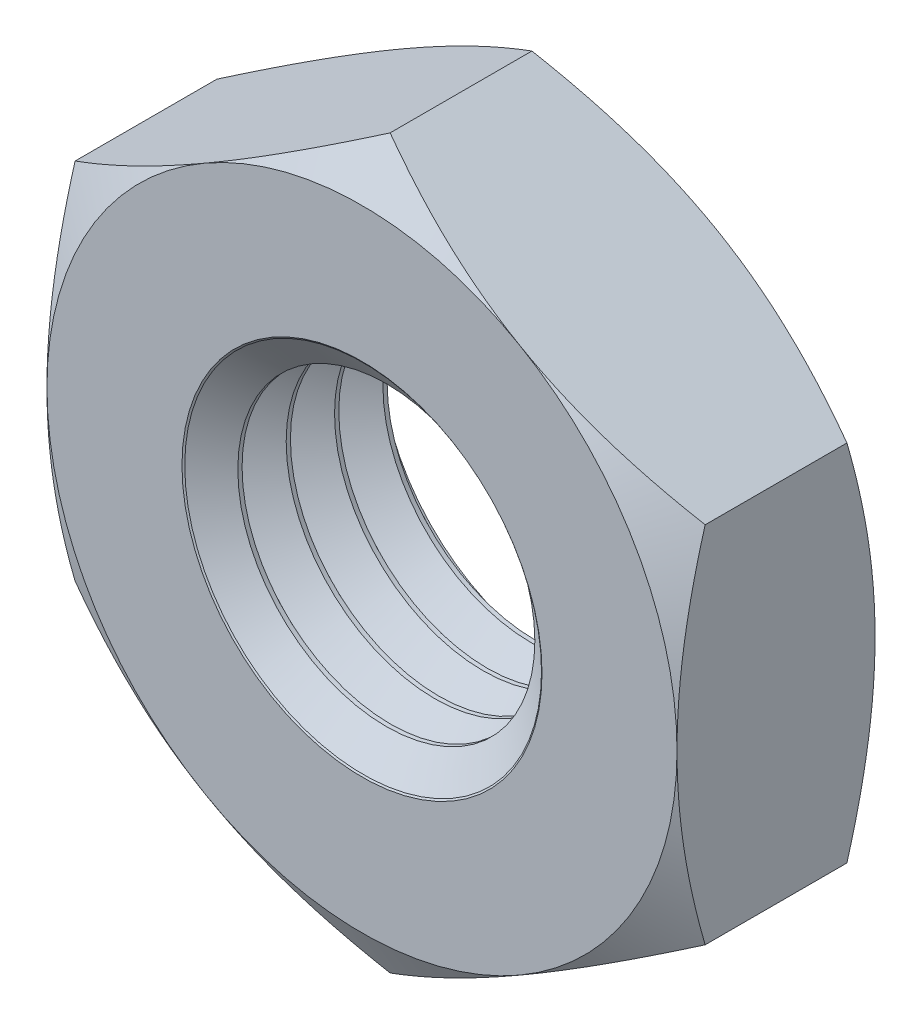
ISO-10303-21;
HEADER;
FILE_DESCRIPTION(('STEP AP214'),'2;1');
FILE_NAME('part.step','',(''),(''),'','','');
FILE_SCHEMA(('AUTOMOTIVE_DESIGN { 1 0 10303 214 1 1 1 1 }'));
ENDSEC;
DATA;
#1=APPLICATION_CONTEXT('core data for automotive mechanical design processes');
#2=APPLICATION_PROTOCOL_DEFINITION('international standard','automotive_design',2000,#1);
#3=PRODUCT_CONTEXT('',#1,'mechanical');
#4=PRODUCT('Part','Part','',(#3));
#5=PRODUCT_RELATED_PRODUCT_CATEGORY('part','',(#4));
#6=PRODUCT_DEFINITION_FORMATION('','',#4);
#7=PRODUCT_DEFINITION_CONTEXT('part definition',#1,'design');
#8=PRODUCT_DEFINITION('design','',#6,#7);
#9=PRODUCT_DEFINITION_SHAPE('','',#8);
#10=(LENGTH_UNIT() NAMED_UNIT(*) SI_UNIT(.MILLI.,.METRE.));
#11=(NAMED_UNIT(*) PLANE_ANGLE_UNIT() SI_UNIT($,.RADIAN.));
#12=(NAMED_UNIT(*) SI_UNIT($,.STERADIAN.) SOLID_ANGLE_UNIT());
#13=UNCERTAINTY_MEASURE_WITH_UNIT(LENGTH_MEASURE(1.E-05),#10,'distance_accuracy_value','');
#14=(GEOMETRIC_REPRESENTATION_CONTEXT(3) GLOBAL_UNCERTAINTY_ASSIGNED_CONTEXT((#13)) GLOBAL_UNIT_ASSIGNED_CONTEXT((#10,
#11,#12)) REPRESENTATION_CONTEXT('',''));
#15=CARTESIAN_POINT('',(0.,0.,0.));
#16=DIRECTION('',(0.,0.,1.));
#17=DIRECTION('',(1.,0.,0.));
#18=AXIS2_PLACEMENT_3D('',#15,#16,#17);
#19=CARTESIAN_POINT('',(0.,0.,-2.2));
#20=DIRECTION('',(0.,0.,1.));
#21=DIRECTION('',(1.,0.,0.));
#22=AXIS2_PLACEMENT_3D('',#19,#20,#21);
#23=CYLINDRICAL_SURFACE('',#22,1.65);
#24=CARTESIAN_POINT('',(0.,0.,-1.8823726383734));
#25=DIRECTION('',(0.,0.,-1.));
#26=DIRECTION('',(-1.,0.,0.));
#27=AXIS2_PLACEMENT_3D('',#24,#25,#26);
#28=CIRCLE('',#27,1.65);
#29=CARTESIAN_POINT('',(-1.65,0.,-1.8823726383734));
#30=VERTEX_POINT('',#29);
#31=EDGE_CURVE('E358',#30,#30,#28,.T.);
#32=ORIENTED_EDGE('',*,*,#31,.F.);
#33=EDGE_LOOP('',(#32));
#34=FACE_BOUND('',#33,.T.);
#35=CARTESIAN_POINT('',(0.,0.,-1.9295273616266));
#36=DIRECTION('',(0.,0.,-1.));
#37=DIRECTION('',(-1.,0.,0.));
#38=AXIS2_PLACEMENT_3D('',#35,#36,#37);
#39=CIRCLE('',#38,1.65);
#40=CARTESIAN_POINT('',(-1.65,0.,-1.9295273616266));
#41=VERTEX_POINT('',#40);
#42=EDGE_CURVE('E179',#41,#41,#39,.F.);
#43=ORIENTED_EDGE('',*,*,#42,.F.);
#44=EDGE_LOOP('',(#43));
#45=FACE_BOUND('',#44,.T.);
#46=ADVANCED_FACE('F37',(#34,#45),#23,.F.);
#47=CARTESIAN_POINT('',(0.,0.,-1.39222736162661));
#48=DIRECTION('',(0.,0.,-1.));
#49=DIRECTION('',(-1.,0.,0.));
#50=AXIS2_PLACEMENT_3D('',#47,#48,#49);
#51=CIRCLE('',#50,1.65);
#52=CARTESIAN_POINT('',(-1.65,0.,-1.39222736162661));
#53=VERTEX_POINT('',#52);
#54=EDGE_CURVE('E361',#53,#53,#51,.T.);
#55=ORIENTED_EDGE('',*,*,#54,.T.);
#56=EDGE_LOOP('',(#55));
#57=FACE_BOUND('',#56,.T.);
#58=CARTESIAN_POINT('',(0.,0.,-1.3450726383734));
#59=DIRECTION('',(0.,0.,-1.));
#60=DIRECTION('',(-1.,0.,0.));
#61=AXIS2_PLACEMENT_3D('',#58,#59,#60);
#62=CIRCLE('',#61,1.65);
#63=CARTESIAN_POINT('',(-1.65,0.,-1.3450726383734));
#64=VERTEX_POINT('',#63);
#65=EDGE_CURVE('E349',#64,#64,#62,.T.);
#66=ORIENTED_EDGE('',*,*,#65,.F.);
#67=EDGE_LOOP('',(#66));
#68=FACE_BOUND('',#67,.T.);
#69=ADVANCED_FACE('F309',(#57,#68),#23,.F.);
#70=CARTESIAN_POINT('',(0.,0.,-0.854927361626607));
#71=DIRECTION('',(0.,0.,-1.));
#72=DIRECTION('',(-1.,0.,0.));
#73=AXIS2_PLACEMENT_3D('',#70,#71,#72);
#74=CIRCLE('',#73,1.65);
#75=CARTESIAN_POINT('',(-1.65,0.,-0.854927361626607));
#76=VERTEX_POINT('',#75);
#77=EDGE_CURVE('E352',#76,#76,#74,.T.);
#78=ORIENTED_EDGE('',*,*,#77,.T.);
#79=EDGE_LOOP('',(#78));
#80=FACE_BOUND('',#79,.T.);
#81=CARTESIAN_POINT('',(0.,0.,-0.807772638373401));
#82=DIRECTION('',(0.,0.,-1.));
#83=DIRECTION('',(-1.,0.,0.));
#84=AXIS2_PLACEMENT_3D('',#81,#82,#83);
#85=CIRCLE('',#84,1.65);
#86=CARTESIAN_POINT('',(-1.65,0.,-0.807772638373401));
#87=VERTEX_POINT('',#86);
#88=EDGE_CURVE('E340',#87,#87,#85,.T.);
#89=ORIENTED_EDGE('',*,*,#88,.F.);
#90=EDGE_LOOP('',(#89));
#91=FACE_BOUND('',#90,.T.);
#92=ADVANCED_FACE('F315',(#80,#91),#23,.F.);
#93=CARTESIAN_POINT('',(0.,0.,-0.317627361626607));
#94=DIRECTION('',(0.,0.,-1.));
#95=DIRECTION('',(-1.,0.,0.));
#96=AXIS2_PLACEMENT_3D('',#93,#94,#95);
#97=CIRCLE('',#96,1.65);
#98=CARTESIAN_POINT('',(-1.65,0.,-0.317627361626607));
#99=VERTEX_POINT('',#98);
#100=EDGE_CURVE('E330',#99,#99,#97,.T.);
#101=ORIENTED_EDGE('',*,*,#100,.T.);
#102=EDGE_LOOP('',(#101));
#103=FACE_BOUND('',#102,.T.);
#104=CARTESIAN_POINT('',(0.,0.,-0.270472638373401));
#105=DIRECTION('',(0.,0.,-1.));
#106=DIRECTION('',(-1.,0.,0.));
#107=AXIS2_PLACEMENT_3D('',#104,#105,#106);
#108=CIRCLE('',#107,1.65);
#109=CARTESIAN_POINT('',(-1.65,0.,-0.270472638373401));
#110=VERTEX_POINT('',#109);
#111=EDGE_CURVE('E333',#110,#110,#108,.T.);
#112=ORIENTED_EDGE('',*,*,#111,.F.);
#113=EDGE_LOOP('',(#112));
#114=FACE_BOUND('',#113,.T.);
#115=ADVANCED_FACE('F311',(#103,#114),#23,.F.);
#116=CARTESIAN_POINT('',(0.,4.04145188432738,-2.2));
#117=DIRECTION('',(-0.500000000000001,0.866025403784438,0.));
#118=DIRECTION('',(-0.866025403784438,-0.500000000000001,0.));
#119=AXIS2_PLACEMENT_3D('',#116,#117,#118);
#120=PLANE('',#119);
#121=DIRECTION('',(0.,0.,1.));
#122=VECTOR('',#121,1.);
#123=CARTESIAN_POINT('',(-3.5,2.02072594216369,-2.2));
#124=LINE('',#123,#122);
#125=CARTESIAN_POINT('',(-3.5,2.02072594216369,-1.88739260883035));
#126=VERTEX_POINT('',#125);
#127=CARTESIAN_POINT('',(-3.5,2.02072594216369,-0.312607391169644));
#128=VERTEX_POINT('',#127);
#129=EDGE_CURVE('E167',#126,#128,#124,.T.);
#130=ORIENTED_EDGE('',*,*,#129,.T.);
#131=CARTESIAN_POINT('',(-3.5002,2.02061047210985,-0.312674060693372));
#132=CARTESIAN_POINT('',(-3.34639282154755,2.10941108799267,-0.261385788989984));
#133=CARTESIAN_POINT('',(-3.19125798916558,2.19897822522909,-0.214740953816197));
#134=CARTESIAN_POINT('',(-2.87830199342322,2.37966345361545,-0.133321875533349));
#135=CARTESIAN_POINT('',(-2.7204752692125,2.47078475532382,-0.098576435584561));
#136=CARTESIAN_POINT('',(-2.40677778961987,2.65189807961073,-0.0444900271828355));
#137=CARTESIAN_POINT('',(-2.25095530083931,2.74186223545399,-0.024789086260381));
#138=CARTESIAN_POINT('',(-1.93857711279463,2.92221386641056,-0.00127013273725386));
#139=CARTESIAN_POINT('',(-1.78202254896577,3.01260068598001,0.00256735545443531));
#140=CARTESIAN_POINT('',(-1.48949078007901,3.1814939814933,-0.00541530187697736));
#141=CARTESIAN_POINT('',(-1.35346978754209,3.26002573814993,-0.015275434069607));
#142=CARTESIAN_POINT('',(-1.08231397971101,3.41657761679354,-0.0465264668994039));
#143=CARTESIAN_POINT('',(-0.947180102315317,3.49459719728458,-0.0679280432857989));
#144=CARTESIAN_POINT('',(-0.675465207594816,3.65147186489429,-0.121430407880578));
#145=CARTESIAN_POINT('',(-0.538918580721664,3.73030709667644,-0.153757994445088));
#146=CARTESIAN_POINT('',(-0.267861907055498,3.88680174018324,-0.227128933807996));
#147=CARTESIAN_POINT('',(-0.133348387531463,3.96446315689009,-0.268155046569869));
#148=CARTESIAN_POINT('',(0.00020000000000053,4.04156735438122,-0.312674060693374));
#149=B_SPLINE_CURVE_WITH_KNOTS('',3,(#131,#132,#133,#134,#135,#136,#137,#138,#139,#140,#141,
#142,#143,#144,#145,#146,#147,#148),.UNSPECIFIED.,.F.,.F.,(4,2,2,2,2,2,2,2,4),(0.,
0.554793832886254,1.11092123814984,1.65328467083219,2.19498204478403,2.6666513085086,
3.13875761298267,3.6213361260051,4.10296698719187),.UNSPECIFIED.);
#150=CARTESIAN_POINT('',(-1.75,3.03108891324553,0.));
#151=VERTEX_POINT('',#150);
#152=EDGE_CURVE('E136',#128,#151,#149,.T.);
#153=ORIENTED_EDGE('',*,*,#152,.T.);
#154=CARTESIAN_POINT('',(0.,4.04145188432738,-0.312607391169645));
#155=VERTEX_POINT('',#154);
#156=EDGE_CURVE('E56',#151,#155,#149,.T.);
#157=ORIENTED_EDGE('',*,*,#156,.T.);
#158=DIRECTION('',(0.,0.,1.));
#159=VECTOR('',#158,1.);
#160=CARTESIAN_POINT('',(0.,4.04145188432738,-2.2));
#161=LINE('',#160,#159);
#162=CARTESIAN_POINT('',(0.,4.04145188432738,-1.88739260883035));
#163=VERTEX_POINT('',#162);
#164=EDGE_CURVE('E152',#163,#155,#161,.T.);
#165=ORIENTED_EDGE('',*,*,#164,.F.);
#166=CARTESIAN_POINT('',(-3.5002,2.02061047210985,-1.88732593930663));
#167=CARTESIAN_POINT('',(-3.34639282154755,2.10941108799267,-1.93861421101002));
#168=CARTESIAN_POINT('',(-3.19125798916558,2.19897822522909,-1.9852590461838));
#169=CARTESIAN_POINT('',(-2.87830199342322,2.37966345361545,-2.06667812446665));
#170=CARTESIAN_POINT('',(-2.7204752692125,2.47078475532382,-2.10142356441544));
#171=CARTESIAN_POINT('',(-2.40677778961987,2.65189807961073,-2.15550997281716));
#172=CARTESIAN_POINT('',(-2.25095530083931,2.74186223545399,-2.17521091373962));
#173=CARTESIAN_POINT('',(-1.93857711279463,2.92221386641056,-2.19872986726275));
#174=CARTESIAN_POINT('',(-1.78202254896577,3.01260068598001,-2.20256735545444));
#175=CARTESIAN_POINT('',(-1.48949078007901,3.1814939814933,-2.19458469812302));
#176=CARTESIAN_POINT('',(-1.35346978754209,3.26002573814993,-2.18472456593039));
#177=CARTESIAN_POINT('',(-1.08231397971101,3.41657761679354,-2.1534735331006));
#178=CARTESIAN_POINT('',(-0.947180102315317,3.49459719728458,-2.1320719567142));
#179=CARTESIAN_POINT('',(-0.675465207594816,3.65147186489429,-2.07856959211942));
#180=CARTESIAN_POINT('',(-0.538918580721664,3.73030709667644,-2.04624200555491));
#181=CARTESIAN_POINT('',(-0.267861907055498,3.88680174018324,-1.972871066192));
#182=CARTESIAN_POINT('',(-0.133348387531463,3.96446315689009,-1.93184495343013));
#183=CARTESIAN_POINT('',(0.000200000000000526,4.04156735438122,-1.88732593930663));
#184=B_SPLINE_CURVE_WITH_KNOTS('',3,(#166,#167,#168,#169,#170,#171,#172,#173,#174,#175,#176,
#177,#178,#179,#180,#181,#182,#183),.UNSPECIFIED.,.F.,.F.,(4,2,2,2,2,2,2,2,4),(0.,
0.554793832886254,1.11092123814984,1.65328467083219,2.19498204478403,2.6666513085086,
3.13875761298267,3.6213361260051,4.10296698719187),.UNSPECIFIED.);
#185=CARTESIAN_POINT('',(-1.75,3.03108891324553,-2.2));
#186=VERTEX_POINT('',#185);
#187=EDGE_CURVE('E170',#186,#163,#184,.T.);
#188=ORIENTED_EDGE('',*,*,#187,.F.);
#189=EDGE_CURVE('E268',#126,#186,#184,.T.);
#190=ORIENTED_EDGE('',*,*,#189,.F.);
#191=EDGE_LOOP('',(#130,#153,#157,#165,#188,#190));
#192=FACE_BOUND('',#191,.T.);
#193=ADVANCED_FACE('F39',(#192),#120,.T.);
#194=CARTESIAN_POINT('',(3.5,2.02072594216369,-2.2));
#195=DIRECTION('',(0.500000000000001,0.866025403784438,0.));
#196=DIRECTION('',(-0.866025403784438,0.500000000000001,0.));
#197=AXIS2_PLACEMENT_3D('',#194,#195,#196);
#198=PLANE('',#197);
#199=ORIENTED_EDGE('',*,*,#164,.T.);
#200=CARTESIAN_POINT('',(-0.000199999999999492,4.04156735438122,-0.312674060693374));
#201=CARTESIAN_POINT('',(0.15360717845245,3.9527667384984,-0.261385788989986));
#202=CARTESIAN_POINT('',(0.308742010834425,3.86319960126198,-0.214740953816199));
#203=CARTESIAN_POINT('',(0.621698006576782,3.68251437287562,-0.13332187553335));
#204=CARTESIAN_POINT('',(0.779524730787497,3.59139307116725,-0.098576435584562));
#205=CARTESIAN_POINT('',(1.09322221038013,3.41027974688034,-0.044490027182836));
#206=CARTESIAN_POINT('',(1.24904469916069,3.32031559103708,-0.0247890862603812));
#207=CARTESIAN_POINT('',(1.56142288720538,3.13996396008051,-0.00127013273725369));
#208=CARTESIAN_POINT('',(1.71797745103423,3.04957714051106,0.00256735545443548));
#209=CARTESIAN_POINT('',(2.01050921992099,2.88068384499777,-0.00541530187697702));
#210=CARTESIAN_POINT('',(2.14653021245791,2.80215208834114,-0.0152754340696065));
#211=CARTESIAN_POINT('',(2.417686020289,2.64560020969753,-0.0465264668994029));
#212=CARTESIAN_POINT('',(2.55281989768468,2.56758062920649,-0.0679280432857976));
#213=CARTESIAN_POINT('',(2.82453479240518,2.41070596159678,-0.121430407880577));
#214=CARTESIAN_POINT('',(2.96108141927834,2.33187072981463,-0.153757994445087));
#215=CARTESIAN_POINT('',(3.2321380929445,2.17537608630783,-0.227128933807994));
#216=CARTESIAN_POINT('',(3.36665161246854,2.09771466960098,-0.268155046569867));
#217=CARTESIAN_POINT('',(3.5002,2.02061047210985,-0.312674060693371));
#218=B_SPLINE_CURVE_WITH_KNOTS('',3,(#200,#201,#202,#203,#204,#205,#206,#207,#208,#209,#210,
#211,#212,#213,#214,#215,#216,#217),.UNSPECIFIED.,.F.,.F.,(4,2,2,2,2,2,2,2,4),(0.,
0.554793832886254,1.11092123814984,1.65328467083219,2.19498204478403,2.6666513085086,
3.13875761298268,3.6213361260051,4.10296698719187),.UNSPECIFIED.);
#219=CARTESIAN_POINT('',(1.75,3.03108891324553,0.));
#220=VERTEX_POINT('',#219);
#221=EDGE_CURVE('E146',#155,#220,#218,.T.);
#222=ORIENTED_EDGE('',*,*,#221,.T.);
#223=CARTESIAN_POINT('',(3.5,2.02072594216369,-0.312607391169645));
#224=VERTEX_POINT('',#223);
#225=EDGE_CURVE('E63',#220,#224,#218,.T.);
#226=ORIENTED_EDGE('',*,*,#225,.T.);
#227=DIRECTION('',(0.,0.,1.));
#228=VECTOR('',#227,1.);
#229=CARTESIAN_POINT('',(3.5,2.02072594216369,-2.2));
#230=LINE('',#229,#228);
#231=CARTESIAN_POINT('',(3.5,2.02072594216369,-1.88739260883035));
#232=VERTEX_POINT('',#231);
#233=EDGE_CURVE('E145',#232,#224,#230,.T.);
#234=ORIENTED_EDGE('',*,*,#233,.F.);
#235=CARTESIAN_POINT('',(-0.000199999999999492,4.04156735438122,-1.88732593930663));
#236=CARTESIAN_POINT('',(0.15360717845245,3.9527667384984,-1.93861421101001));
#237=CARTESIAN_POINT('',(0.308742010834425,3.86319960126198,-1.9852590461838));
#238=CARTESIAN_POINT('',(0.621698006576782,3.68251437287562,-2.06667812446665));
#239=CARTESIAN_POINT('',(0.779524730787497,3.59139307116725,-2.10142356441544));
#240=CARTESIAN_POINT('',(1.09322221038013,3.41027974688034,-2.15550997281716));
#241=CARTESIAN_POINT('',(1.24904469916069,3.32031559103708,-2.17521091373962));
#242=CARTESIAN_POINT('',(1.56142288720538,3.13996396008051,-2.19872986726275));
#243=CARTESIAN_POINT('',(1.71797745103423,3.04957714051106,-2.20256735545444));
#244=CARTESIAN_POINT('',(2.01050921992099,2.88068384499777,-2.19458469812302));
#245=CARTESIAN_POINT('',(2.14653021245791,2.80215208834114,-2.18472456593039));
#246=CARTESIAN_POINT('',(2.417686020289,2.64560020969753,-2.1534735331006));
#247=CARTESIAN_POINT('',(2.55281989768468,2.56758062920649,-2.1320719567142));
#248=CARTESIAN_POINT('',(2.82453479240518,2.41070596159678,-2.07856959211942));
#249=CARTESIAN_POINT('',(2.96108141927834,2.33187072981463,-2.04624200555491));
#250=CARTESIAN_POINT('',(3.2321380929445,2.17537608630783,-1.97287106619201));
#251=CARTESIAN_POINT('',(3.36665161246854,2.09771466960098,-1.93184495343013));
#252=CARTESIAN_POINT('',(3.5002,2.02061047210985,-1.88732593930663));
#253=B_SPLINE_CURVE_WITH_KNOTS('',3,(#235,#236,#237,#238,#239,#240,#241,#242,#243,#244,#245,
#246,#247,#248,#249,#250,#251,#252),.UNSPECIFIED.,.F.,.F.,(4,2,2,2,2,2,2,2,4),(0.,
0.554793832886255,1.11092123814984,1.65328467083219,2.19498204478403,2.6666513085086,
3.13875761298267,3.6213361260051,4.10296698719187),.UNSPECIFIED.);
#254=CARTESIAN_POINT('',(1.75,3.03108891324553,-2.2));
#255=VERTEX_POINT('',#254);
#256=EDGE_CURVE('E261',#255,#232,#253,.T.);
#257=ORIENTED_EDGE('',*,*,#256,.F.);
#258=EDGE_CURVE('E267',#163,#255,#253,.T.);
#259=ORIENTED_EDGE('',*,*,#258,.F.);
#260=EDGE_LOOP('',(#199,#222,#226,#234,#257,#259));
#261=FACE_BOUND('',#260,.T.);
#262=ADVANCED_FACE('F143',(#261),#198,.T.);
#263=CARTESIAN_POINT('',(3.5,2.02072594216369,-2.2));
#264=DIRECTION('',(-1.,0.,0.));
#265=DIRECTION('',(0.,0.,1.));
#266=AXIS2_PLACEMENT_3D('',#263,#264,#265);
#267=PLANE('',#266);
#268=CARTESIAN_POINT('',(3.5,-5.35926299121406,-1.67484346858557));
#269=CARTESIAN_POINT('',(3.5,-5.20559319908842,-1.60058173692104));
#270=CARTESIAN_POINT('',(3.5,-5.05156008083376,-1.52705822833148));
#271=CARTESIAN_POINT('',(3.5,-4.7425707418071,-1.38190950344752));
#272=CARTESIAN_POINT('',(3.5,-4.58761436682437,-1.31028461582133));
#273=CARTESIAN_POINT('',(3.5,-4.27574500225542,-1.16897765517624));
#274=CARTESIAN_POINT('',(3.5,-4.11882589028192,-1.09930904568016));
#275=CARTESIAN_POINT('',(3.5,-3.80369792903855,-0.962964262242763));
#276=CARTESIAN_POINT('',(3.5,-3.64548914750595,-0.896287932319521));
#277=CARTESIAN_POINT('',(3.5,-3.32556618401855,-0.76593181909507));
#278=CARTESIAN_POINT('',(3.5,-3.16383281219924,-0.702298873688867));
#279=CARTESIAN_POINT('',(3.5,-2.83845840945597,-0.580016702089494));
#280=CARTESIAN_POINT('',(3.5,-2.67481716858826,-0.521368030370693));
#281=CARTESIAN_POINT('',(3.5,-2.34570278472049,-0.410630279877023));
#282=CARTESIAN_POINT('',(3.5,-2.18023438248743,-0.358527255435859));
#283=CARTESIAN_POINT('',(3.5,-1.8469452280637,-0.262572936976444));
#284=CARTESIAN_POINT('',(3.5,-1.6791252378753,-0.218719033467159));
#285=CARTESIAN_POINT('',(3.5,-1.34101828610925,-0.141391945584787));
#286=CARTESIAN_POINT('',(3.5,-1.17073068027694,-0.107921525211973));
#287=CARTESIAN_POINT('',(3.5,-0.828102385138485,-0.0536149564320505));
#288=CARTESIAN_POINT('',(3.5,-0.655761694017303,-0.0327788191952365));
#289=CARTESIAN_POINT('',(3.5,-0.31102049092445,-0.00558408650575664));
#290=CARTESIAN_POINT('',(3.5,-0.13862739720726,0.0008661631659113));
#291=CARTESIAN_POINT('',(3.5,0.206038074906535,-0.00105355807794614));
#292=CARTESIAN_POINT('',(3.5,0.37831047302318,-0.00941968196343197));
#293=CARTESIAN_POINT('',(3.5,0.672490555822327,-0.0357688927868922));
#294=CARTESIAN_POINT('',(3.5,0.794722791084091,-0.0503206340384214));
#295=CARTESIAN_POINT('',(3.5,1.0382430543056,-0.0859367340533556));
#296=CARTESIAN_POINT('',(3.5,1.15953093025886,-0.107002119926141));
#297=CARTESIAN_POINT('',(3.5,1.52187914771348,-0.178863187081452));
#298=CARTESIAN_POINT('',(3.5,1.76124104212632,-0.23830527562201));
#299=CARTESIAN_POINT('',(3.5,2.11940971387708,-0.340826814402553));
#300=CARTESIAN_POINT('',(3.5,2.24008344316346,-0.377749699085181));
#301=CARTESIAN_POINT('',(3.5,2.48017139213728,-0.455249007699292));
#302=CARTESIAN_POINT('',(3.5,2.59958641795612,-0.495822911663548));
#303=CARTESIAN_POINT('',(3.5,2.83665760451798,-0.579779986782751));
#304=CARTESIAN_POINT('',(3.5,2.95431988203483,-0.623146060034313));
#305=CARTESIAN_POINT('',(3.5,3.18873153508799,-0.712423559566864));
#306=CARTESIAN_POINT('',(3.5,3.30548051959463,-0.758336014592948));
#307=CARTESIAN_POINT('',(3.5,3.42180736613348,-0.805270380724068));
#308=B_SPLINE_CURVE_WITH_KNOTS('',3,(#268,#269,#270,#271,#272,#273,#274,#275,#276,#277,#278,
#279,#280,#281,#282,#283,#284,#285,#286,#287,#288,#289,#290,#291,#292,#293,#294,#295,#296,#297,
#298,#299,#300,#301,#302,#303,#304,#305,#306,#307),.UNSPECIFIED.,.F.,.F.,(4,2,2,2,2,2,2,2,2,2,2,
2,2,2,2,2,2,2,2,4),(0.,0.512025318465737,1.02413870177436,1.53918270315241,2.05419982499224,
2.57553975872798,3.09693761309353,3.61720506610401,4.13730766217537,4.65754858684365,
5.17778997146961,5.69470725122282,6.21149033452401,6.58059623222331,6.94976036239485,
7.68863804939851,8.06719621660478,8.4454950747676,8.82166461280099,9.1979872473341),.UNSPECIFIED.);
#309=CARTESIAN_POINT('',(3.5,-2.0207259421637,-0.312607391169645));
#310=VERTEX_POINT('',#309);
#311=CARTESIAN_POINT('',(3.5,0.,0.));
#312=VERTEX_POINT('',#311);
#313=EDGE_CURVE('E138',#310,#312,#308,.T.);
#314=ORIENTED_EDGE('',*,*,#313,.F.);
#315=DIRECTION('',(0.,0.,1.));
#316=VECTOR('',#315,1.);
#317=CARTESIAN_POINT('',(3.5,-2.0207259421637,-2.2));
#318=LINE('',#317,#316);
#319=CARTESIAN_POINT('',(3.5,-2.0207259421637,-1.88739260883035));
#320=VERTEX_POINT('',#319);
#321=EDGE_CURVE('E153',#320,#310,#318,.T.);
#322=ORIENTED_EDGE('',*,*,#321,.F.);
#323=CARTESIAN_POINT('',(3.5,-5.35926299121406,-0.525156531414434));
#324=CARTESIAN_POINT('',(3.5,-5.20559319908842,-0.599418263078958));
#325=CARTESIAN_POINT('',(3.5,-5.05156008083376,-0.672941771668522));
#326=CARTESIAN_POINT('',(3.5,-4.7425707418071,-0.818090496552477));
#327=CARTESIAN_POINT('',(3.5,-4.58761436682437,-0.889715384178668));
#328=CARTESIAN_POINT('',(3.5,-4.27574500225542,-1.03102234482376));
#329=CARTESIAN_POINT('',(3.5,-4.11882589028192,-1.10069095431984));
#330=CARTESIAN_POINT('',(3.5,-3.80369792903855,-1.23703573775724));
#331=CARTESIAN_POINT('',(3.5,-3.64548914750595,-1.30371206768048));
#332=CARTESIAN_POINT('',(3.5,-3.32556618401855,-1.43406818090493));
#333=CARTESIAN_POINT('',(3.5,-3.16383281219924,-1.49770112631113));
#334=CARTESIAN_POINT('',(3.5,-2.83845840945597,-1.61998329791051));
#335=CARTESIAN_POINT('',(3.5,-2.67481716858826,-1.67863196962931));
#336=CARTESIAN_POINT('',(3.5,-2.34570278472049,-1.78936972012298));
#337=CARTESIAN_POINT('',(3.5,-2.18023438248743,-1.84147274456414));
#338=CARTESIAN_POINT('',(3.5,-1.8469452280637,-1.93742706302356));
#339=CARTESIAN_POINT('',(3.5,-1.6791252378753,-1.98128096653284));
#340=CARTESIAN_POINT('',(3.5,-1.34101828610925,-2.05860805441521));
#341=CARTESIAN_POINT('',(3.5,-1.17073068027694,-2.09207847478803));
#342=CARTESIAN_POINT('',(3.5,-0.828102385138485,-2.14638504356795));
#343=CARTESIAN_POINT('',(3.5,-0.655761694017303,-2.16722118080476));
#344=CARTESIAN_POINT('',(3.5,-0.31102049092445,-2.19441591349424));
#345=CARTESIAN_POINT('',(3.5,-0.13862739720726,-2.20086616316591));
#346=CARTESIAN_POINT('',(3.5,0.206038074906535,-2.19894644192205));
#347=CARTESIAN_POINT('',(3.5,0.37831047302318,-2.19058031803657));
#348=CARTESIAN_POINT('',(3.5,0.672490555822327,-2.16423110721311));
#349=CARTESIAN_POINT('',(3.5,0.794722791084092,-2.14967936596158));
#350=CARTESIAN_POINT('',(3.5,1.0382430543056,-2.11406326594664));
#351=CARTESIAN_POINT('',(3.5,1.15953093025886,-2.09299788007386));
#352=CARTESIAN_POINT('',(3.5,1.52187914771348,-2.02113681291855));
#353=CARTESIAN_POINT('',(3.5,1.76124104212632,-1.96169472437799));
#354=CARTESIAN_POINT('',(3.5,2.11940971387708,-1.85917318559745));
#355=CARTESIAN_POINT('',(3.5,2.24008344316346,-1.82225030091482));
#356=CARTESIAN_POINT('',(3.5,2.48017139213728,-1.74475099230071));
#357=CARTESIAN_POINT('',(3.5,2.59958641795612,-1.70417708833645));
#358=CARTESIAN_POINT('',(3.5,2.83665760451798,-1.62022001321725));
#359=CARTESIAN_POINT('',(3.5,2.95431988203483,-1.57685393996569));
#360=CARTESIAN_POINT('',(3.5,3.18873153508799,-1.48757644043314));
#361=CARTESIAN_POINT('',(3.5,3.30548051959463,-1.44166398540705));
#362=CARTESIAN_POINT('',(3.5,3.42180736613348,-1.39472961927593));
#363=B_SPLINE_CURVE_WITH_KNOTS('',3,(#323,#324,#325,#326,#327,#328,#329,#330,#331,#332,#333,
#334,#335,#336,#337,#338,#339,#340,#341,#342,#343,#344,#345,#346,#347,#348,#349,#350,#351,#352,
#353,#354,#355,#356,#357,#358,#359,#360,#361,#362),.UNSPECIFIED.,.F.,.F.,(4,2,2,2,2,2,2,2,2,2,2,
2,2,2,2,2,2,2,2,4),(0.,0.512025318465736,1.02413870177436,1.53918270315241,2.05419982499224,
2.57553975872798,3.09693761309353,3.61720506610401,4.13730766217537,4.65754858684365,
5.17778997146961,5.69470725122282,6.21149033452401,6.58059623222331,6.94976036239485,
7.68863804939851,8.06719621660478,8.4454950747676,8.82166461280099,9.1979872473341),.UNSPECIFIED.);
#364=CARTESIAN_POINT('',(3.5,0.,-2.2));
#365=VERTEX_POINT('',#364);
#366=EDGE_CURVE('E275',#320,#365,#363,.T.);
#367=ORIENTED_EDGE('',*,*,#366,.T.);
#368=EDGE_CURVE('E151',#365,#232,#363,.T.);
#369=ORIENTED_EDGE('',*,*,#368,.T.);
#370=ORIENTED_EDGE('',*,*,#233,.T.);
#371=EDGE_CURVE('E128',#312,#224,#308,.T.);
#372=ORIENTED_EDGE('',*,*,#371,.F.);
#373=EDGE_LOOP('',(#314,#322,#367,#369,#370,#372));
#374=FACE_BOUND('',#373,.T.);
#375=ADVANCED_FACE('F149',(#374),#267,.F.);
#376=CARTESIAN_POINT('',(0.,-4.04145188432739,-2.2));
#377=DIRECTION('',(0.500000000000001,-0.866025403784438,0.));
#378=DIRECTION('',(0.866025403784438,0.500000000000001,0.));
#379=AXIS2_PLACEMENT_3D('',#376,#377,#378);
#380=PLANE('',#379);
#381=ORIENTED_EDGE('',*,*,#321,.T.);
#382=CARTESIAN_POINT('',(3.5002,-2.02061047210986,-0.312674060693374));
#383=CARTESIAN_POINT('',(3.34639282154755,-2.10941108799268,-0.261385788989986));
#384=CARTESIAN_POINT('',(3.19125798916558,-2.1989782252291,-0.214740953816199));
#385=CARTESIAN_POINT('',(2.87830199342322,-2.37966345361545,-0.133321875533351));
#386=CARTESIAN_POINT('',(2.7204752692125,-2.47078475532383,-0.0985764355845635));
#387=CARTESIAN_POINT('',(2.40677778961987,-2.65189807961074,-0.0444900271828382));
#388=CARTESIAN_POINT('',(2.25095530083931,-2.741862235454,-0.0247890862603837));
#389=CARTESIAN_POINT('',(1.93857711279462,-2.92221386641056,-0.00127013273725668));
#390=CARTESIAN_POINT('',(1.78202254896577,-3.01260068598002,0.00256735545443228));
#391=CARTESIAN_POINT('',(1.48949078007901,-3.18149398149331,-0.0054153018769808));
#392=CARTESIAN_POINT('',(1.35346978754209,-3.26002573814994,-0.0152754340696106));
#393=CARTESIAN_POINT('',(1.082313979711,-3.41657761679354,-0.0465264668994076));
#394=CARTESIAN_POINT('',(0.947180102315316,-3.49459719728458,-0.0679280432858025));
#395=CARTESIAN_POINT('',(0.675465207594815,-3.65147186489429,-0.121430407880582));
#396=CARTESIAN_POINT('',(0.538918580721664,-3.73030709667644,-0.153757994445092));
#397=CARTESIAN_POINT('',(0.267861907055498,-3.88680174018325,-0.227128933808));
#398=CARTESIAN_POINT('',(0.133348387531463,-3.9644631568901,-0.268155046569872));
#399=CARTESIAN_POINT('',(-0.000200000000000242,-4.04156735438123,-0.312674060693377));
#400=B_SPLINE_CURVE_WITH_KNOTS('',3,(#382,#383,#384,#385,#386,#387,#388,#389,#390,#391,#392,
#393,#394,#395,#396,#397,#398,#399),.UNSPECIFIED.,.F.,.F.,(4,2,2,2,2,2,2,2,4),(0.,
0.554793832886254,1.11092123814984,1.65328467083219,2.19498204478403,2.6666513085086,
3.13875761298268,3.6213361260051,4.10296698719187),.UNSPECIFIED.);
#401=CARTESIAN_POINT('',(1.75,-3.03108891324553,0.));
#402=VERTEX_POINT('',#401);
#403=EDGE_CURVE('E440',#310,#402,#400,.T.);
#404=ORIENTED_EDGE('',*,*,#403,.T.);
#405=CARTESIAN_POINT('',(0.,-4.04145188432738,-0.312607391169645));
#406=VERTEX_POINT('',#405);
#407=EDGE_CURVE('E229',#402,#406,#400,.T.);
#408=ORIENTED_EDGE('',*,*,#407,.T.);
#409=DIRECTION('',(0.,0.,1.));
#410=VECTOR('',#409,1.);
#411=CARTESIAN_POINT('',(0.,-4.04145188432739,-2.2));
#412=LINE('',#411,#410);
#413=CARTESIAN_POINT('',(0.,-4.04145188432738,-1.88739260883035));
#414=VERTEX_POINT('',#413);
#415=EDGE_CURVE('E158',#414,#406,#412,.T.);
#416=ORIENTED_EDGE('',*,*,#415,.F.);
#417=CARTESIAN_POINT('',(3.5002,-2.02061047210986,-1.88732593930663));
#418=CARTESIAN_POINT('',(3.34639282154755,-2.10941108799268,-1.93861421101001));
#419=CARTESIAN_POINT('',(3.19125798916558,-2.1989782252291,-1.9852590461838));
#420=CARTESIAN_POINT('',(2.87830199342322,-2.37966345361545,-2.06667812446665));
#421=CARTESIAN_POINT('',(2.7204752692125,-2.47078475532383,-2.10142356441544));
#422=CARTESIAN_POINT('',(2.40677778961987,-2.65189807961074,-2.15550997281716));
#423=CARTESIAN_POINT('',(2.25095530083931,-2.741862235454,-2.17521091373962));
#424=CARTESIAN_POINT('',(1.93857711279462,-2.92221386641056,-2.19872986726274));
#425=CARTESIAN_POINT('',(1.78202254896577,-3.01260068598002,-2.20256735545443));
#426=CARTESIAN_POINT('',(1.48949078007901,-3.18149398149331,-2.19458469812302));
#427=CARTESIAN_POINT('',(1.35346978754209,-3.26002573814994,-2.18472456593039));
#428=CARTESIAN_POINT('',(1.082313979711,-3.41657761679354,-2.15347353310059));
#429=CARTESIAN_POINT('',(0.947180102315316,-3.49459719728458,-2.1320719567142));
#430=CARTESIAN_POINT('',(0.675465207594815,-3.65147186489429,-2.07856959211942));
#431=CARTESIAN_POINT('',(0.538918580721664,-3.73030709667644,-2.04624200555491));
#432=CARTESIAN_POINT('',(0.267861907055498,-3.88680174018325,-1.972871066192));
#433=CARTESIAN_POINT('',(0.133348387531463,-3.9644631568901,-1.93184495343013));
#434=CARTESIAN_POINT('',(-0.000200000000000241,-4.04156735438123,-1.88732593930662));
#435=B_SPLINE_CURVE_WITH_KNOTS('',3,(#417,#418,#419,#420,#421,#422,#423,#424,#425,#426,#427,
#428,#429,#430,#431,#432,#433,#434),.UNSPECIFIED.,.F.,.F.,(4,2,2,2,2,2,2,2,4),(0.,
0.554793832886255,1.11092123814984,1.65328467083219,2.19498204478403,2.6666513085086,
3.13875761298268,3.6213361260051,4.10296698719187),.UNSPECIFIED.);
#436=CARTESIAN_POINT('',(1.75,-3.03108891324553,-2.2));
#437=VERTEX_POINT('',#436);
#438=EDGE_CURVE('E282',#437,#414,#435,.T.);
#439=ORIENTED_EDGE('',*,*,#438,.F.);
#440=EDGE_CURVE('E281',#320,#437,#435,.T.);
#441=ORIENTED_EDGE('',*,*,#440,.F.);
#442=EDGE_LOOP('',(#381,#404,#408,#416,#439,#441));
#443=FACE_BOUND('',#442,.T.);
#444=ADVANCED_FACE('F294',(#443),#380,.T.);
#445=CARTESIAN_POINT('',(-3.5,-2.02072594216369,-2.2));
#446=DIRECTION('',(-0.500000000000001,-0.866025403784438,0.));
#447=DIRECTION('',(0.866025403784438,-0.500000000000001,0.));
#448=AXIS2_PLACEMENT_3D('',#445,#446,#447);
#449=PLANE('',#448);
#450=ORIENTED_EDGE('',*,*,#415,.T.);
#451=CARTESIAN_POINT('',(0.000199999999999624,-4.04156735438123,-0.312674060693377));
#452=CARTESIAN_POINT('',(-0.15360717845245,-3.95276673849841,-0.261385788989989));
#453=CARTESIAN_POINT('',(-0.308742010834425,-3.86319960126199,-0.214740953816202));
#454=CARTESIAN_POINT('',(-0.621698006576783,-3.68251437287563,-0.133321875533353));
#455=CARTESIAN_POINT('',(-0.779524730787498,-3.59139307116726,-0.0985764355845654));
#456=CARTESIAN_POINT('',(-1.09322221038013,-3.41027974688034,-0.0444900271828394));
#457=CARTESIAN_POINT('',(-1.2490446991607,-3.32031559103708,-0.0247890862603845));
#458=CARTESIAN_POINT('',(-1.56142288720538,-3.13996396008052,-0.00127013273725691));
#459=CARTESIAN_POINT('',(-1.71797745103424,-3.04957714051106,0.00256735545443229));
#460=CARTESIAN_POINT('',(-2.01050921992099,-2.88068384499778,-0.00541530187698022));
#461=CARTESIAN_POINT('',(-2.14653021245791,-2.80215208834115,-0.0152754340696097));
#462=CARTESIAN_POINT('',(-2.417686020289,-2.64560020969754,-0.0465264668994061));
#463=CARTESIAN_POINT('',(-2.55281989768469,-2.5675806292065,-0.0679280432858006));
#464=CARTESIAN_POINT('',(-2.82453479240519,-2.41070596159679,-0.121430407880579));
#465=CARTESIAN_POINT('',(-2.96108141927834,-2.33187072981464,-0.153757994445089));
#466=CARTESIAN_POINT('',(-3.2321380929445,-2.17537608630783,-0.227128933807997));
#467=CARTESIAN_POINT('',(-3.36665161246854,-2.09771466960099,-0.268155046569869));
#468=CARTESIAN_POINT('',(-3.5002,-2.02061047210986,-0.312674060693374));
#469=B_SPLINE_CURVE_WITH_KNOTS('',3,(#451,#452,#453,#454,#455,#456,#457,#458,#459,#460,#461,
#462,#463,#464,#465,#466,#467,#468),.UNSPECIFIED.,.F.,.F.,(4,2,2,2,2,2,2,2,4),(0.,
0.554793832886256,1.11092123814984,1.65328467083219,2.19498204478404,2.66665130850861,
3.13875761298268,3.6213361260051,4.10296698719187),.UNSPECIFIED.);
#470=CARTESIAN_POINT('',(-1.75,-3.03108891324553,0.));
#471=VERTEX_POINT('',#470);
#472=EDGE_CURVE('E443',#406,#471,#469,.T.);
#473=ORIENTED_EDGE('',*,*,#472,.T.);
#474=CARTESIAN_POINT('',(-3.5,-2.02072594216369,-0.312607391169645));
#475=VERTEX_POINT('',#474);
#476=EDGE_CURVE('E202',#471,#475,#469,.T.);
#477=ORIENTED_EDGE('',*,*,#476,.T.);
#478=DIRECTION('',(0.,0.,1.));
#479=VECTOR('',#478,1.);
#480=CARTESIAN_POINT('',(-3.5,-2.02072594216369,-2.2));
#481=LINE('',#480,#479);
#482=CARTESIAN_POINT('',(-3.5,-2.02072594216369,-1.88739260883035));
#483=VERTEX_POINT('',#482);
#484=EDGE_CURVE('E164',#483,#475,#481,.T.);
#485=ORIENTED_EDGE('',*,*,#484,.F.);
#486=CARTESIAN_POINT('',(0.000199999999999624,-4.04156735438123,-1.88732593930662));
#487=CARTESIAN_POINT('',(-0.15360717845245,-3.95276673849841,-1.93861421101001));
#488=CARTESIAN_POINT('',(-0.308742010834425,-3.86319960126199,-1.9852590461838));
#489=CARTESIAN_POINT('',(-0.621698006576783,-3.68251437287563,-2.06667812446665));
#490=CARTESIAN_POINT('',(-0.779524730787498,-3.59139307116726,-2.10142356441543));
#491=CARTESIAN_POINT('',(-1.09322221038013,-3.41027974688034,-2.15550997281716));
#492=CARTESIAN_POINT('',(-1.24904469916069,-3.32031559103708,-2.17521091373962));
#493=CARTESIAN_POINT('',(-1.56142288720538,-3.13996396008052,-2.19872986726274));
#494=CARTESIAN_POINT('',(-1.71797745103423,-3.04957714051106,-2.20256735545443));
#495=CARTESIAN_POINT('',(-2.01050921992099,-2.88068384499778,-2.19458469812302));
#496=CARTESIAN_POINT('',(-2.14653021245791,-2.80215208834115,-2.18472456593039));
#497=CARTESIAN_POINT('',(-2.417686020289,-2.64560020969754,-2.15347353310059));
#498=CARTESIAN_POINT('',(-2.55281989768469,-2.5675806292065,-2.1320719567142));
#499=CARTESIAN_POINT('',(-2.82453479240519,-2.41070596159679,-2.07856959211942));
#500=CARTESIAN_POINT('',(-2.96108141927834,-2.33187072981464,-2.04624200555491));
#501=CARTESIAN_POINT('',(-3.2321380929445,-2.17537608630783,-1.972871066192));
#502=CARTESIAN_POINT('',(-3.36665161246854,-2.09771466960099,-1.93184495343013));
#503=CARTESIAN_POINT('',(-3.5002,-2.02061047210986,-1.88732593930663));
#504=B_SPLINE_CURVE_WITH_KNOTS('',3,(#486,#487,#488,#489,#490,#491,#492,#493,#494,#495,#496,
#497,#498,#499,#500,#501,#502,#503),.UNSPECIFIED.,.F.,.F.,(4,2,2,2,2,2,2,2,4),(0.,
0.554793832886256,1.11092123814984,1.65328467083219,2.19498204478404,2.6666513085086,
3.13875761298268,3.6213361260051,4.10296698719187),.UNSPECIFIED.);
#505=CARTESIAN_POINT('',(-1.75,-3.03108891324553,-2.2));
#506=VERTEX_POINT('',#505);
#507=EDGE_CURVE('E289',#506,#483,#504,.T.);
#508=ORIENTED_EDGE('',*,*,#507,.F.);
#509=EDGE_CURVE('E288',#414,#506,#504,.T.);
#510=ORIENTED_EDGE('',*,*,#509,.F.);
#511=EDGE_LOOP('',(#450,#473,#477,#485,#508,#510));
#512=FACE_BOUND('',#511,.T.);
#513=ADVANCED_FACE('F297',(#512),#449,.T.);
#514=CARTESIAN_POINT('',(-3.5,2.02072594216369,-2.2));
#515=DIRECTION('',(-1.,0.,0.));
#516=DIRECTION('',(0.,0.,1.));
#517=AXIS2_PLACEMENT_3D('',#514,#515,#516);
#518=PLANE('',#517);
#519=ORIENTED_EDGE('',*,*,#484,.T.);
#520=CARTESIAN_POINT('',(-3.5,-5.35926299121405,-1.67484346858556));
#521=CARTESIAN_POINT('',(-3.5,-5.20559319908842,-1.60058173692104));
#522=CARTESIAN_POINT('',(-3.5,-5.05156008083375,-1.52705822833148));
#523=CARTESIAN_POINT('',(-3.5,-4.7425707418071,-1.38190950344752));
#524=CARTESIAN_POINT('',(-3.5,-4.58761436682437,-1.31028461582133));
#525=CARTESIAN_POINT('',(-3.5,-4.27574500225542,-1.16897765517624));
#526=CARTESIAN_POINT('',(-3.5,-4.11882589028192,-1.09930904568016));
#527=CARTESIAN_POINT('',(-3.5,-3.80369792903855,-0.962964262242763));
#528=CARTESIAN_POINT('',(-3.5,-3.64548914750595,-0.896287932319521));
#529=CARTESIAN_POINT('',(-3.5,-3.32556618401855,-0.765931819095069));
#530=CARTESIAN_POINT('',(-3.5,-3.16383281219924,-0.702298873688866));
#531=CARTESIAN_POINT('',(-3.5,-2.83845840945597,-0.580016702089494));
#532=CARTESIAN_POINT('',(-3.5,-2.67481716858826,-0.521368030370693));
#533=CARTESIAN_POINT('',(-3.5,-2.34570278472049,-0.410630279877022));
#534=CARTESIAN_POINT('',(-3.5,-2.18023438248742,-0.358527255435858));
#535=CARTESIAN_POINT('',(-3.5,-1.8469452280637,-0.262572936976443));
#536=CARTESIAN_POINT('',(-3.5,-1.6791252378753,-0.218719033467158));
#537=CARTESIAN_POINT('',(-3.5,-1.34101828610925,-0.141391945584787));
#538=CARTESIAN_POINT('',(-3.5,-1.17073068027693,-0.107921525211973));
#539=CARTESIAN_POINT('',(-3.5,-0.828102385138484,-0.0536149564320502));
#540=CARTESIAN_POINT('',(-3.5,-0.655761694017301,-0.0327788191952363));
#541=CARTESIAN_POINT('',(-3.5,-0.311020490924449,-0.00558408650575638));
#542=CARTESIAN_POINT('',(-3.5,-0.138627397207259,0.000866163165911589));
#543=CARTESIAN_POINT('',(-3.5,0.206038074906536,-0.00105355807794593));
#544=CARTESIAN_POINT('',(-3.5,0.37831047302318,-0.00941968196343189));
#545=CARTESIAN_POINT('',(-3.5,0.672490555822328,-0.0357688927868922));
#546=CARTESIAN_POINT('',(-3.5,0.794722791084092,-0.0503206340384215));
#547=CARTESIAN_POINT('',(-3.5,1.0382430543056,-0.0859367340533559));
#548=CARTESIAN_POINT('',(-3.5,1.15953093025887,-0.107002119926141));
#549=CARTESIAN_POINT('',(-3.5,1.52187914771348,-0.178863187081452));
#550=CARTESIAN_POINT('',(-3.5,1.76124104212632,-0.238305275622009));
#551=CARTESIAN_POINT('',(-3.5,2.11940971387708,-0.340826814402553));
#552=CARTESIAN_POINT('',(-3.5,2.24008344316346,-0.377749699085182));
#553=CARTESIAN_POINT('',(-3.5,2.48017139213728,-0.455249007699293));
#554=CARTESIAN_POINT('',(-3.5,2.59958641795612,-0.495822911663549));
#555=CARTESIAN_POINT('',(-3.5,2.83665760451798,-0.579779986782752));
#556=CARTESIAN_POINT('',(-3.5,2.95431988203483,-0.623146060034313));
#557=CARTESIAN_POINT('',(-3.5,3.18873153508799,-0.712423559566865));
#558=CARTESIAN_POINT('',(-3.5,3.30548051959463,-0.758336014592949));
#559=CARTESIAN_POINT('',(-3.5,3.42180736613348,-0.805270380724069));
#560=B_SPLINE_CURVE_WITH_KNOTS('',3,(#520,#521,#522,#523,#524,#525,#526,#527,#528,#529,#530,
#531,#532,#533,#534,#535,#536,#537,#538,#539,#540,#541,#542,#543,#544,#545,#546,#547,#548,#549,
#550,#551,#552,#553,#554,#555,#556,#557,#558,#559),.UNSPECIFIED.,.F.,.F.,(4,2,2,2,2,2,2,2,2,2,2,
2,2,2,2,2,2,2,2,4),(0.,0.512025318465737,1.02413870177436,1.53918270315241,2.05419982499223,
2.57553975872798,3.09693761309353,3.61720506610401,4.13730766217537,4.65754858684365,
5.17778997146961,5.69470725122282,6.21149033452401,6.58059623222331,6.94976036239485,
7.68863804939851,8.06719621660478,8.4454950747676,8.82166461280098,9.1979872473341),.UNSPECIFIED.);
#561=CARTESIAN_POINT('',(-3.5,0.,0.));
#562=VERTEX_POINT('',#561);
#563=EDGE_CURVE('E201',#475,#562,#560,.T.);
#564=ORIENTED_EDGE('',*,*,#563,.T.);
#565=EDGE_CURVE('E189',#562,#128,#560,.T.);
#566=ORIENTED_EDGE('',*,*,#565,.T.);
#567=ORIENTED_EDGE('',*,*,#129,.F.);
#568=CARTESIAN_POINT('',(-3.5,-5.35926299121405,-0.525156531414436));
#569=CARTESIAN_POINT('',(-3.5,-5.20559319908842,-0.59941826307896));
#570=CARTESIAN_POINT('',(-3.5,-5.05156008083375,-0.672941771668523));
#571=CARTESIAN_POINT('',(-3.5,-4.7425707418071,-0.818090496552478));
#572=CARTESIAN_POINT('',(-3.5,-4.58761436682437,-0.889715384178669));
#573=CARTESIAN_POINT('',(-3.5,-4.27574500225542,-1.03102234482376));
#574=CARTESIAN_POINT('',(-3.5,-4.11882589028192,-1.10069095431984));
#575=CARTESIAN_POINT('',(-3.5,-3.80369792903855,-1.23703573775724));
#576=CARTESIAN_POINT('',(-3.5,-3.64548914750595,-1.30371206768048));
#577=CARTESIAN_POINT('',(-3.5,-3.32556618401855,-1.43406818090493));
#578=CARTESIAN_POINT('',(-3.5,-3.16383281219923,-1.49770112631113));
#579=CARTESIAN_POINT('',(-3.5,-2.83845840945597,-1.61998329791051));
#580=CARTESIAN_POINT('',(-3.5,-2.67481716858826,-1.67863196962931));
#581=CARTESIAN_POINT('',(-3.5,-2.34570278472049,-1.78936972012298));
#582=CARTESIAN_POINT('',(-3.5,-2.18023438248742,-1.84147274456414));
#583=CARTESIAN_POINT('',(-3.5,-1.8469452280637,-1.93742706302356));
#584=CARTESIAN_POINT('',(-3.5,-1.6791252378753,-1.98128096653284));
#585=CARTESIAN_POINT('',(-3.5,-1.34101828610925,-2.05860805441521));
#586=CARTESIAN_POINT('',(-3.5,-1.17073068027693,-2.09207847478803));
#587=CARTESIAN_POINT('',(-3.5,-0.828102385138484,-2.14638504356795));
#588=CARTESIAN_POINT('',(-3.5,-0.655761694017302,-2.16722118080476));
#589=CARTESIAN_POINT('',(-3.5,-0.31102049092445,-2.19441591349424));
#590=CARTESIAN_POINT('',(-3.5,-0.13862739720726,-2.20086616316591));
#591=CARTESIAN_POINT('',(-3.5,0.206038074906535,-2.19894644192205));
#592=CARTESIAN_POINT('',(-3.5,0.37831047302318,-2.19058031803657));
#593=CARTESIAN_POINT('',(-3.5,0.672490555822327,-2.16423110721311));
#594=CARTESIAN_POINT('',(-3.5,0.794722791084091,-2.14967936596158));
#595=CARTESIAN_POINT('',(-3.5,1.0382430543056,-2.11406326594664));
#596=CARTESIAN_POINT('',(-3.5,1.15953093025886,-2.09299788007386));
#597=CARTESIAN_POINT('',(-3.5,1.52187914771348,-2.02113681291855));
#598=CARTESIAN_POINT('',(-3.5,1.76124104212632,-1.96169472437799));
#599=CARTESIAN_POINT('',(-3.5,2.11940971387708,-1.85917318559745));
#600=CARTESIAN_POINT('',(-3.5,2.24008344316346,-1.82225030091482));
#601=CARTESIAN_POINT('',(-3.5,2.48017139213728,-1.74475099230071));
#602=CARTESIAN_POINT('',(-3.5,2.59958641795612,-1.70417708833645));
#603=CARTESIAN_POINT('',(-3.5,2.83665760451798,-1.62022001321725));
#604=CARTESIAN_POINT('',(-3.5,2.95431988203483,-1.57685393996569));
#605=CARTESIAN_POINT('',(-3.5,3.18873153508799,-1.48757644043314));
#606=CARTESIAN_POINT('',(-3.5,3.30548051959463,-1.44166398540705));
#607=CARTESIAN_POINT('',(-3.5,3.42180736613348,-1.39472961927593));
#608=B_SPLINE_CURVE_WITH_KNOTS('',3,(#568,#569,#570,#571,#572,#573,#574,#575,#576,#577,#578,
#579,#580,#581,#582,#583,#584,#585,#586,#587,#588,#589,#590,#591,#592,#593,#594,#595,#596,#597,
#598,#599,#600,#601,#602,#603,#604,#605,#606,#607),.UNSPECIFIED.,.F.,.F.,(4,2,2,2,2,2,2,2,2,2,2,
2,2,2,2,2,2,2,2,4),(0.,0.512025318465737,1.02413870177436,1.53918270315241,2.05419982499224,
2.57553975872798,3.09693761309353,3.61720506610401,4.13730766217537,4.65754858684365,
5.17778997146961,5.69470725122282,6.21149033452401,6.58059623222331,6.94976036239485,
7.68863804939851,8.06719621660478,8.4454950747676,8.82166461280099,9.1979872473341),.UNSPECIFIED.);
#609=CARTESIAN_POINT('',(-3.5,0.,-2.2));
#610=VERTEX_POINT('',#609);
#611=EDGE_CURVE('E460',#610,#126,#608,.T.);
#612=ORIENTED_EDGE('',*,*,#611,.F.);
#613=EDGE_CURVE('E462',#483,#610,#608,.T.);
#614=ORIENTED_EDGE('',*,*,#613,.F.);
#615=EDGE_LOOP('',(#519,#564,#566,#567,#612,#614));
#616=FACE_BOUND('',#615,.T.);
#617=ADVANCED_FACE('F209',(#616),#518,.T.);
#618=CARTESIAN_POINT('',(0.,4.04145188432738,0.));
#619=DIRECTION('',(0.,0.,-1.));
#620=DIRECTION('',(-1.,0.,0.));
#621=AXIS2_PLACEMENT_3D('',#618,#619,#620);
#622=PLANE('',#621);
#623=CARTESIAN_POINT('',(0.,0.,0.));
#624=DIRECTION('',(0.,0.,1.));
#625=DIRECTION('',(1.,0.,0.));
#626=AXIS2_PLACEMENT_3D('',#623,#624,#625);
#627=CIRCLE('',#626,2.);
#628=CARTESIAN_POINT('',(2.,0.,0.));
#629=VERTEX_POINT('',#628);
#630=EDGE_CURVE('E182',#629,#629,#627,.T.);
#631=ORIENTED_EDGE('',*,*,#630,.F.);
#632=EDGE_LOOP('',(#631));
#633=FACE_BOUND('',#632,.T.);
#634=CARTESIAN_POINT('',(0.,0.,0.));
#635=DIRECTION('',(0.,0.,-1.));
#636=DIRECTION('',(-1.,0.,0.));
#637=AXIS2_PLACEMENT_3D('',#634,#635,#636);
#638=CIRCLE('',#637,3.5);
#639=EDGE_CURVE('E11',#562,#151,#638,.T.);
#640=ORIENTED_EDGE('',*,*,#639,.F.);
#641=EDGE_CURVE('E49',#471,#562,#638,.T.);
#642=ORIENTED_EDGE('',*,*,#641,.F.);
#643=EDGE_CURVE('E176',#402,#471,#638,.T.);
#644=ORIENTED_EDGE('',*,*,#643,.F.);
#645=EDGE_CURVE('E437',#312,#402,#638,.T.);
#646=ORIENTED_EDGE('',*,*,#645,.F.);
#647=CARTESIAN_POINT('',(0.,0.,0.));
#648=DIRECTION('',(0.,0.,1.));
#649=DIRECTION('',(1.,0.,0.));
#650=AXIS2_PLACEMENT_3D('',#647,#648,#649);
#651=CIRCLE('',#650,3.5);
#652=EDGE_CURVE('E131',#312,#220,#651,.T.);
#653=ORIENTED_EDGE('',*,*,#652,.T.);
#654=EDGE_CURVE('E47',#151,#220,#638,.T.);
#655=ORIENTED_EDGE('',*,*,#654,.F.);
#656=EDGE_LOOP('',(#640,#642,#644,#646,#653,#655));
#657=FACE_BOUND('',#656,.T.);
#658=ADVANCED_FACE('F257',(#633,#657),#622,.F.);
#659=CARTESIAN_POINT('',(0.,4.04145188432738,-2.2));
#660=DIRECTION('',(0.,0.,-1.));
#661=DIRECTION('',(-1.,0.,0.));
#662=AXIS2_PLACEMENT_3D('',#659,#660,#661);
#663=PLANE('',#662);
#664=CARTESIAN_POINT('',(0.,0.,-2.2));
#665=DIRECTION('',(0.,0.,-1.));
#666=DIRECTION('',(-1.,0.,0.));
#667=AXIS2_PLACEMENT_3D('',#664,#665,#666);
#668=CIRCLE('',#667,2.);
#669=CARTESIAN_POINT('',(-2.,0.,-2.2));
#670=VERTEX_POINT('',#669);
#671=EDGE_CURVE('E177',#670,#670,#668,.F.);
#672=ORIENTED_EDGE('',*,*,#671,.T.);
#673=EDGE_LOOP('',(#672));
#674=FACE_BOUND('',#673,.T.);
#675=CARTESIAN_POINT('',(0.,0.,-2.2));
#676=DIRECTION('',(0.,0.,-1.));
#677=DIRECTION('',(-1.,0.,0.));
#678=AXIS2_PLACEMENT_3D('',#675,#676,#677);
#679=CIRCLE('',#678,3.5);
#680=EDGE_CURVE('E173',#610,#506,#679,.F.);
#681=ORIENTED_EDGE('',*,*,#680,.F.);
#682=EDGE_CURVE('E155',#186,#610,#679,.F.);
#683=ORIENTED_EDGE('',*,*,#682,.F.);
#684=EDGE_CURVE('E172',#255,#186,#679,.F.);
#685=ORIENTED_EDGE('',*,*,#684,.F.);
#686=CARTESIAN_POINT('',(0.,0.,-2.2));
#687=DIRECTION('',(0.,0.,1.));
#688=DIRECTION('',(1.,0.,0.));
#689=AXIS2_PLACEMENT_3D('',#686,#687,#688);
#690=CIRCLE('',#689,3.5);
#691=EDGE_CURVE('E252',#365,#255,#690,.T.);
#692=ORIENTED_EDGE('',*,*,#691,.F.);
#693=EDGE_CURVE('E479',#437,#365,#679,.F.);
#694=ORIENTED_EDGE('',*,*,#693,.F.);
#695=EDGE_CURVE('E501',#506,#437,#679,.F.);
#696=ORIENTED_EDGE('',*,*,#695,.F.);
#697=EDGE_LOOP('',(#681,#683,#685,#692,#694,#696));
#698=FACE_BOUND('',#697,.T.);
#699=ADVANCED_FACE('F477',(#674,#698),#663,.T.);
#700=CARTESIAN_POINT('',(0.,0.,-2.2));
#701=DIRECTION('',(0.,0.,1.));
#702=DIRECTION('',(1.,0.,0.));
#703=AXIS2_PLACEMENT_3D('',#700,#701,#702);
#704=CONICAL_SURFACE('',#703,3.5,1.0471975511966);
#705=ORIENTED_EDGE('',*,*,#189,.T.);
#706=ORIENTED_EDGE('',*,*,#682,.T.);
#707=ORIENTED_EDGE('',*,*,#611,.T.);
#708=EDGE_LOOP('',(#705,#706,#707));
#709=FACE_BOUND('',#708,.T.);
#710=ADVANCED_FACE('F483',(#709),#704,.T.);
#711=ORIENTED_EDGE('',*,*,#187,.T.);
#712=ORIENTED_EDGE('',*,*,#258,.T.);
#713=ORIENTED_EDGE('',*,*,#684,.T.);
#714=EDGE_LOOP('',(#711,#712,#713));
#715=FACE_BOUND('',#714,.T.);
#716=ADVANCED_FACE('F481',(#715),#704,.T.);
#717=ORIENTED_EDGE('',*,*,#256,.T.);
#718=ORIENTED_EDGE('',*,*,#368,.F.);
#719=ORIENTED_EDGE('',*,*,#691,.T.);
#720=EDGE_LOOP('',(#717,#718,#719));
#721=FACE_BOUND('',#720,.T.);
#722=ADVANCED_FACE('F472',(#721),#704,.T.);
#723=ORIENTED_EDGE('',*,*,#440,.T.);
#724=ORIENTED_EDGE('',*,*,#693,.T.);
#725=ORIENTED_EDGE('',*,*,#366,.F.);
#726=EDGE_LOOP('',(#723,#724,#725));
#727=FACE_BOUND('',#726,.T.);
#728=ADVANCED_FACE('F488',(#727),#704,.T.);
#729=ORIENTED_EDGE('',*,*,#438,.T.);
#730=ORIENTED_EDGE('',*,*,#509,.T.);
#731=ORIENTED_EDGE('',*,*,#695,.T.);
#732=EDGE_LOOP('',(#729,#730,#731));
#733=FACE_BOUND('',#732,.T.);
#734=ADVANCED_FACE('F489',(#733),#704,.T.);
#735=ORIENTED_EDGE('',*,*,#507,.T.);
#736=ORIENTED_EDGE('',*,*,#613,.T.);
#737=ORIENTED_EDGE('',*,*,#680,.T.);
#738=EDGE_LOOP('',(#735,#736,#737));
#739=FACE_BOUND('',#738,.T.);
#740=ADVANCED_FACE('F217',(#739),#704,.T.);
#741=CARTESIAN_POINT('',(0.,0.,0.));
#742=DIRECTION('',(0.,0.,-1.));
#743=DIRECTION('',(-1.,0.,0.));
#744=AXIS2_PLACEMENT_3D('',#741,#742,#743);
#745=CONICAL_SURFACE('',#744,3.5,1.0471975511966);
#746=ORIENTED_EDGE('',*,*,#641,.T.);
#747=ORIENTED_EDGE('',*,*,#563,.F.);
#748=ORIENTED_EDGE('',*,*,#476,.F.);
#749=EDGE_LOOP('',(#746,#747,#748));
#750=FACE_BOUND('',#749,.T.);
#751=ADVANCED_FACE('F211',(#750),#745,.T.);
#752=ORIENTED_EDGE('',*,*,#643,.T.);
#753=ORIENTED_EDGE('',*,*,#472,.F.);
#754=ORIENTED_EDGE('',*,*,#407,.F.);
#755=EDGE_LOOP('',(#752,#753,#754));
#756=FACE_BOUND('',#755,.T.);
#757=ADVANCED_FACE('F216',(#756),#745,.T.);
#758=ORIENTED_EDGE('',*,*,#313,.T.);
#759=ORIENTED_EDGE('',*,*,#645,.T.);
#760=ORIENTED_EDGE('',*,*,#403,.F.);
#761=EDGE_LOOP('',(#758,#759,#760));
#762=FACE_BOUND('',#761,.T.);
#763=ADVANCED_FACE('F425',(#762),#745,.T.);
#764=ORIENTED_EDGE('',*,*,#652,.F.);
#765=ORIENTED_EDGE('',*,*,#371,.T.);
#766=ORIENTED_EDGE('',*,*,#225,.F.);
#767=EDGE_LOOP('',(#764,#765,#766));
#768=FACE_BOUND('',#767,.T.);
#769=ADVANCED_FACE('F129',(#768),#745,.T.);
#770=ORIENTED_EDGE('',*,*,#654,.T.);
#771=ORIENTED_EDGE('',*,*,#221,.F.);
#772=ORIENTED_EDGE('',*,*,#156,.F.);
#773=EDGE_LOOP('',(#770,#771,#772));
#774=FACE_BOUND('',#773,.T.);
#775=ADVANCED_FACE('F219',(#774),#745,.T.);
#776=ORIENTED_EDGE('',*,*,#565,.F.);
#777=ORIENTED_EDGE('',*,*,#639,.T.);
#778=ORIENTED_EDGE('',*,*,#152,.F.);
#779=EDGE_LOOP('',(#776,#777,#778));
#780=FACE_BOUND('',#779,.T.);
#781=ADVANCED_FACE('F420',(#780),#745,.T.);
#782=CARTESIAN_POINT('',(0.,0.,-0.269579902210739));
#783=DIRECTION('',(0.,0.,1.));
#784=DIRECTION('',(1.,0.,0.));
#785=AXIS2_PLACEMENT_3D('',#782,#783,#784);
#786=CONICAL_SURFACE('',#785,1.615,0.95993108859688);
#787=CARTESIAN_POINT('',(0.,0.,-0.0127));
#788=DIRECTION('',(0.,0.,-1.));
#789=DIRECTION('',(-1.,0.,0.));
#790=AXIS2_PLACEMENT_3D('',#787,#788,#789);
#791=CIRCLE('',#790,1.98186252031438);
#792=CARTESIAN_POINT('',(-1.98186252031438,0.,-0.0127));
#793=VERTEX_POINT('',#792);
#794=EDGE_CURVE('E42',#793,#793,#791,.F.);
#795=ORIENTED_EDGE('',*,*,#794,.F.);
#796=EDGE_LOOP('',(#795));
#797=FACE_BOUND('',#796,.T.);
#798=ORIENTED_EDGE('',*,*,#630,.T.);
#799=EDGE_LOOP('',(#798));
#800=FACE_BOUND('',#799,.T.);
#801=ADVANCED_FACE('F220',(#797,#800),#786,.F.);
#802=CARTESIAN_POINT('',(0.,0.,-2.1746));
#803=DIRECTION('',(0.,0.,-1.));
#804=DIRECTION('',(-1.,0.,0.));
#805=AXIS2_PLACEMENT_3D('',#802,#803,#804);
#806=CONICAL_SURFACE('',#805,2.,0.95993108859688);
#807=CARTESIAN_POINT('',(0.,0.,-2.1746));
#808=DIRECTION('',(0.,0.,1.));
#809=DIRECTION('',(1.,0.,0.));
#810=AXIS2_PLACEMENT_3D('',#807,#808,#809);
#811=CIRCLE('',#810,2.);
#812=CARTESIAN_POINT('',(2.,0.,-2.1746));
#813=VERTEX_POINT('',#812);
#814=EDGE_CURVE('E180',#813,#813,#811,.T.);
#815=ORIENTED_EDGE('',*,*,#814,.F.);
#816=EDGE_LOOP('',(#815));
#817=FACE_BOUND('',#816,.T.);
#818=ORIENTED_EDGE('',*,*,#42,.T.);
#819=EDGE_LOOP('',(#818));
#820=FACE_BOUND('',#819,.T.);
#821=ADVANCED_FACE('F404',(#817,#820),#806,.F.);
#822=CARTESIAN_POINT('',(0.,0.,-25.0375057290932));
#823=DIRECTION('',(0.,0.,1.));
#824=DIRECTION('',(1.,0.,0.));
#825=AXIS2_PLACEMENT_3D('',#822,#823,#824);
#826=CYLINDRICAL_SURFACE('',#825,2.);
#827=ORIENTED_EDGE('',*,*,#671,.F.);
#828=EDGE_LOOP('',(#827));
#829=FACE_BOUND('',#828,.T.);
#830=ORIENTED_EDGE('',*,*,#814,.T.);
#831=EDGE_LOOP('',(#830));
#832=FACE_BOUND('',#831,.T.);
#833=ADVANCED_FACE('F402',(#829,#832),#826,.F.);
#834=CARTESIAN_POINT('',(0.,0.,-0.0254));
#835=DIRECTION('',(0.,0.,-1.));
#836=DIRECTION('',(-1.,0.,0.));
#837=AXIS2_PLACEMENT_3D('',#834,#835,#836);
#838=CONICAL_SURFACE('',#837,2.,0.959931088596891);
#839=ORIENTED_EDGE('',*,*,#794,.T.);
#840=EDGE_LOOP('',(#839));
#841=FACE_BOUND('',#840,.T.);
#842=CARTESIAN_POINT('',(0.,0.,-0.0254));
#843=DIRECTION('',(0.,0.,-1.));
#844=DIRECTION('',(-1.,0.,0.));
#845=AXIS2_PLACEMENT_3D('',#842,#843,#844);
#846=CIRCLE('',#845,2.);
#847=CARTESIAN_POINT('',(-2.,0.,-0.0254));
#848=VERTEX_POINT('',#847);
#849=EDGE_CURVE('E335',#848,#848,#846,.T.);
#850=ORIENTED_EDGE('',*,*,#849,.T.);
#851=EDGE_LOOP('',(#850));
#852=FACE_BOUND('',#851,.T.);
#853=ADVANCED_FACE('F398',(#841,#852),#838,.F.);
#854=CARTESIAN_POINT('',(0.,0.,-0.270472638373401));
#855=DIRECTION('',(0.,0.,1.));
#856=DIRECTION('',(1.,0.,0.));
#857=AXIS2_PLACEMENT_3D('',#854,#855,#856);
#858=CONICAL_SURFACE('',#857,1.65,0.959931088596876);
#859=ORIENTED_EDGE('',*,*,#849,.F.);
#860=EDGE_LOOP('',(#859));
#861=FACE_BOUND('',#860,.T.);
#862=ORIENTED_EDGE('',*,*,#111,.T.);
#863=EDGE_LOOP('',(#862));
#864=FACE_BOUND('',#863,.T.);
#865=ADVANCED_FACE('F394',(#861,#864),#858,.F.);
#866=CARTESIAN_POINT('',(0.,0.,-0.5627));
#867=DIRECTION('',(0.,0.,-1.));
#868=DIRECTION('',(-1.,0.,0.));
#869=AXIS2_PLACEMENT_3D('',#866,#867,#868);
#870=CONICAL_SURFACE('',#869,2.,0.959931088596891);
#871=ORIENTED_EDGE('',*,*,#100,.F.);
#872=EDGE_LOOP('',(#871));
#873=FACE_BOUND('',#872,.T.);
#874=CARTESIAN_POINT('',(0.,0.,-0.5627));
#875=DIRECTION('',(0.,0.,-1.));
#876=DIRECTION('',(-1.,0.,0.));
#877=AXIS2_PLACEMENT_3D('',#874,#875,#876);
#878=CIRCLE('',#877,2.);
#879=CARTESIAN_POINT('',(-2.,0.,-0.5627));
#880=VERTEX_POINT('',#879);
#881=EDGE_CURVE('E336',#880,#880,#878,.T.);
#882=ORIENTED_EDGE('',*,*,#881,.T.);
#883=EDGE_LOOP('',(#882));
#884=FACE_BOUND('',#883,.T.);
#885=ADVANCED_FACE('F390',(#873,#884),#870,.F.);
#886=CARTESIAN_POINT('',(0.,0.,-0.807772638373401));
#887=DIRECTION('',(0.,0.,1.));
#888=DIRECTION('',(1.,0.,0.));
#889=AXIS2_PLACEMENT_3D('',#886,#887,#888);
#890=CONICAL_SURFACE('',#889,1.65,0.959931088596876);
#891=ORIENTED_EDGE('',*,*,#881,.F.);
#892=EDGE_LOOP('',(#891));
#893=FACE_BOUND('',#892,.T.);
#894=ORIENTED_EDGE('',*,*,#88,.T.);
#895=EDGE_LOOP('',(#894));
#896=FACE_BOUND('',#895,.T.);
#897=ADVANCED_FACE('F386',(#893,#896),#890,.F.);
#898=CARTESIAN_POINT('',(0.,0.,-1.1));
#899=DIRECTION('',(0.,0.,-1.));
#900=DIRECTION('',(-1.,0.,0.));
#901=AXIS2_PLACEMENT_3D('',#898,#899,#900);
#902=CONICAL_SURFACE('',#901,2.,0.959931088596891);
#903=ORIENTED_EDGE('',*,*,#77,.F.);
#904=EDGE_LOOP('',(#903));
#905=FACE_BOUND('',#904,.T.);
#906=CARTESIAN_POINT('',(0.,0.,-1.1));
#907=DIRECTION('',(0.,0.,-1.));
#908=DIRECTION('',(-1.,0.,0.));
#909=AXIS2_PLACEMENT_3D('',#906,#907,#908);
#910=CIRCLE('',#909,2.);
#911=CARTESIAN_POINT('',(-2.,0.,-1.1));
#912=VERTEX_POINT('',#911);
#913=EDGE_CURVE('E346',#912,#912,#910,.T.);
#914=ORIENTED_EDGE('',*,*,#913,.T.);
#915=EDGE_LOOP('',(#914));
#916=FACE_BOUND('',#915,.T.);
#917=ADVANCED_FACE('F382',(#905,#916),#902,.F.);
#918=CARTESIAN_POINT('',(0.,0.,-1.3450726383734));
#919=DIRECTION('',(0.,0.,1.));
#920=DIRECTION('',(1.,0.,0.));
#921=AXIS2_PLACEMENT_3D('',#918,#919,#920);
#922=CONICAL_SURFACE('',#921,1.65,0.959931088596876);
#923=ORIENTED_EDGE('',*,*,#913,.F.);
#924=EDGE_LOOP('',(#923));
#925=FACE_BOUND('',#924,.T.);
#926=ORIENTED_EDGE('',*,*,#65,.T.);
#927=EDGE_LOOP('',(#926));
#928=FACE_BOUND('',#927,.T.);
#929=ADVANCED_FACE('F370',(#925,#928),#922,.F.);
#930=CARTESIAN_POINT('',(0.,0.,-1.6373));
#931=DIRECTION('',(0.,0.,-1.));
#932=DIRECTION('',(-1.,0.,0.));
#933=AXIS2_PLACEMENT_3D('',#930,#931,#932);
#934=CONICAL_SURFACE('',#933,2.,0.959931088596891);
#935=ORIENTED_EDGE('',*,*,#54,.F.);
#936=EDGE_LOOP('',(#935));
#937=FACE_BOUND('',#936,.T.);
#938=CARTESIAN_POINT('',(0.,0.,-1.6373));
#939=DIRECTION('',(0.,0.,-1.));
#940=DIRECTION('',(-1.,0.,0.));
#941=AXIS2_PLACEMENT_3D('',#938,#939,#940);
#942=CIRCLE('',#941,2.);
#943=CARTESIAN_POINT('',(-2.,0.,-1.6373));
#944=VERTEX_POINT('',#943);
#945=EDGE_CURVE('E355',#944,#944,#942,.T.);
#946=ORIENTED_EDGE('',*,*,#945,.T.);
#947=EDGE_LOOP('',(#946));
#948=FACE_BOUND('',#947,.T.);
#949=ADVANCED_FACE('F366',(#937,#948),#934,.F.);
#950=CARTESIAN_POINT('',(0.,0.,-1.8823726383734));
#951=DIRECTION('',(0.,0.,1.));
#952=DIRECTION('',(1.,0.,0.));
#953=AXIS2_PLACEMENT_3D('',#950,#951,#952);
#954=CONICAL_SURFACE('',#953,1.65,0.959931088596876);
#955=ORIENTED_EDGE('',*,*,#945,.F.);
#956=EDGE_LOOP('',(#955));
#957=FACE_BOUND('',#956,.T.);
#958=ORIENTED_EDGE('',*,*,#31,.T.);
#959=EDGE_LOOP('',(#958));
#960=FACE_BOUND('',#959,.T.);
#961=ADVANCED_FACE('F369',(#957,#960),#954,.F.);
#962=CLOSED_SHELL('',(#46,#69,#92,#115,#193,#262,#375,#444,#513,#617,#658,#699,#710,#716,#722,
#728,#734,#740,#751,#757,#763,#769,#775,#781,#801,#821,#833,#853,#865,#885,#897,#917,#929,#949,#961));
#963=MANIFOLD_SOLID_BREP('B2',#962);
#964=ADVANCED_BREP_SHAPE_REPRESENTATION('',(#18,#963),#14);
#965=SHAPE_DEFINITION_REPRESENTATION(#9,#964);
ENDSEC;
END-ISO-10303-21;
